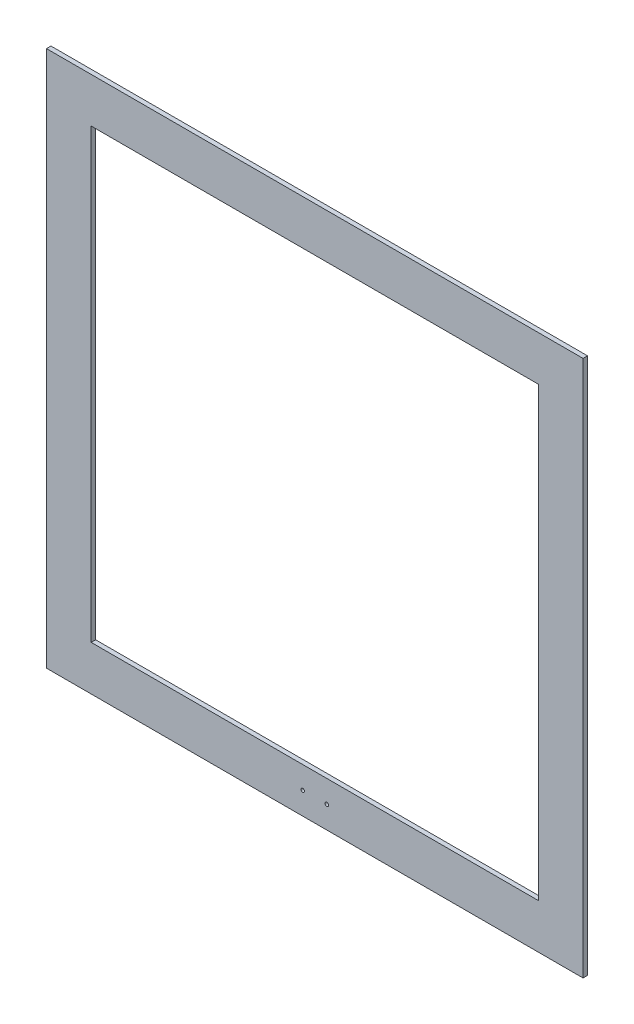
ISO-10303-21;
HEADER;
FILE_DESCRIPTION(('STEP AP214'),'2;1');
FILE_NAME('part.step','',(''),(''),'','','');
FILE_SCHEMA(('AUTOMOTIVE_DESIGN { 1 0 10303 214 1 1 1 1 }'));
ENDSEC;
DATA;
#1=APPLICATION_CONTEXT('core data for automotive mechanical design processes');
#2=APPLICATION_PROTOCOL_DEFINITION('international standard','automotive_design',2000,#1);
#3=PRODUCT_CONTEXT('',#1,'mechanical');
#4=PRODUCT('Part','Part','',(#3));
#5=PRODUCT_RELATED_PRODUCT_CATEGORY('part','',(#4));
#6=PRODUCT_DEFINITION_FORMATION('','',#4);
#7=PRODUCT_DEFINITION_CONTEXT('part definition',#1,'design');
#8=PRODUCT_DEFINITION('design','',#6,#7);
#9=PRODUCT_DEFINITION_SHAPE('','',#8);
#10=(LENGTH_UNIT() NAMED_UNIT(*) SI_UNIT(.MILLI.,.METRE.));
#11=(NAMED_UNIT(*) PLANE_ANGLE_UNIT() SI_UNIT($,.RADIAN.));
#12=(NAMED_UNIT(*) SI_UNIT($,.STERADIAN.) SOLID_ANGLE_UNIT());
#13=UNCERTAINTY_MEASURE_WITH_UNIT(LENGTH_MEASURE(1.E-05),#10,'distance_accuracy_value','');
#14=(GEOMETRIC_REPRESENTATION_CONTEXT(3) GLOBAL_UNCERTAINTY_ASSIGNED_CONTEXT((#13)) GLOBAL_UNIT_ASSIGNED_CONTEXT((#10,
#11,#12)) REPRESENTATION_CONTEXT('',''));
#15=CARTESIAN_POINT('',(0.,0.,0.));
#16=DIRECTION('',(0.,0.,1.));
#17=DIRECTION('',(1.,0.,0.));
#18=AXIS2_PLACEMENT_3D('',#15,#16,#17);
#19=CARTESIAN_POINT('',(0.,0.,5.));
#20=DIRECTION('',(0.,0.,1.));
#21=DIRECTION('',(1.,0.,0.));
#22=AXIS2_PLACEMENT_3D('',#19,#20,#21);
#23=PLANE('',#22);
#24=CARTESIAN_POINT('',(13.5,-275.,5.));
#25=DIRECTION('',(0.,0.,1.));
#26=DIRECTION('',(-1.,0.,0.));
#27=AXIS2_PLACEMENT_3D('',#24,#25,#26);
#28=CIRCLE('',#27,2.);
#29=CARTESIAN_POINT('',(11.5,-275.,5.));
#30=VERTEX_POINT('',#29);
#31=EDGE_CURVE('E227',#30,#30,#28,.T.);
#32=ORIENTED_EDGE('',*,*,#31,.F.);
#33=EDGE_LOOP('',(#32));
#34=FACE_BOUND('',#33,.T.);
#35=CARTESIAN_POINT('',(-13.5,-275.,5.));
#36=DIRECTION('',(0.,0.,1.));
#37=DIRECTION('',(1.,0.,0.));
#38=AXIS2_PLACEMENT_3D('',#35,#36,#37);
#39=CIRCLE('',#38,2.);
#40=CARTESIAN_POINT('',(-11.5,-275.,5.));
#41=VERTEX_POINT('',#40);
#42=EDGE_CURVE('E231',#41,#41,#39,.T.);
#43=ORIENTED_EDGE('',*,*,#42,.F.);
#44=EDGE_LOOP('',(#43));
#45=FACE_BOUND('',#44,.T.);
#46=DIRECTION('',(0.,1.,0.));
#47=VECTOR('',#46,1.);
#48=CARTESIAN_POINT('',(300.,300.,5.));
#49=LINE('',#48,#47);
#50=CARTESIAN_POINT('',(300.,-300.,5.));
#51=VERTEX_POINT('',#50);
#52=CARTESIAN_POINT('',(300.,300.,5.));
#53=VERTEX_POINT('',#52);
#54=EDGE_CURVE('E136',#51,#53,#49,.T.);
#55=ORIENTED_EDGE('',*,*,#54,.T.);
#56=DIRECTION('',(-1.,0.,0.));
#57=VECTOR('',#56,1.);
#58=CARTESIAN_POINT('',(-299.999999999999,300.,5.));
#59=LINE('',#58,#57);
#60=CARTESIAN_POINT('',(-299.999999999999,300.,5.));
#61=VERTEX_POINT('',#60);
#62=EDGE_CURVE('E139',#53,#61,#59,.T.);
#63=ORIENTED_EDGE('',*,*,#62,.T.);
#64=DIRECTION('',(0.,-1.,0.));
#65=VECTOR('',#64,1.);
#66=CARTESIAN_POINT('',(-299.999999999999,300.,5.));
#67=LINE('',#66,#65);
#68=CARTESIAN_POINT('',(-299.999999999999,-300.,5.));
#69=VERTEX_POINT('',#68);
#70=EDGE_CURVE('E142',#61,#69,#67,.T.);
#71=ORIENTED_EDGE('',*,*,#70,.T.);
#72=DIRECTION('',(1.,0.,0.));
#73=VECTOR('',#72,1.);
#74=CARTESIAN_POINT('',(-299.999999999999,-300.,5.));
#75=LINE('',#74,#73);
#76=EDGE_CURVE('E144',#69,#51,#75,.T.);
#77=ORIENTED_EDGE('',*,*,#76,.T.);
#78=EDGE_LOOP('',(#55,#63,#71,#77));
#79=FACE_BOUND('',#78,.T.);
#80=DIRECTION('',(-1.,0.,0.));
#81=VECTOR('',#80,1.);
#82=CARTESIAN_POINT('',(-250.,250.,5.));
#83=LINE('',#82,#81);
#84=CARTESIAN_POINT('',(250.,250.,5.));
#85=VERTEX_POINT('',#84);
#86=CARTESIAN_POINT('',(-250.,250.,5.));
#87=VERTEX_POINT('',#86);
#88=EDGE_CURVE('E106',#85,#87,#83,.T.);
#89=ORIENTED_EDGE('',*,*,#88,.F.);
#90=DIRECTION('',(0.,1.,0.));
#91=VECTOR('',#90,1.);
#92=CARTESIAN_POINT('',(250.,250.,5.));
#93=LINE('',#92,#91);
#94=CARTESIAN_POINT('',(250.,-250.,5.));
#95=VERTEX_POINT('',#94);
#96=EDGE_CURVE('E98',#95,#85,#93,.T.);
#97=ORIENTED_EDGE('',*,*,#96,.F.);
#98=DIRECTION('',(1.,0.,0.));
#99=VECTOR('',#98,1.);
#100=CARTESIAN_POINT('',(-250.,-250.,5.));
#101=LINE('',#100,#99);
#102=CARTESIAN_POINT('',(-250.,-250.,5.));
#103=VERTEX_POINT('',#102);
#104=EDGE_CURVE('E120',#103,#95,#101,.T.);
#105=ORIENTED_EDGE('',*,*,#104,.F.);
#106=DIRECTION('',(0.,-1.,0.));
#107=VECTOR('',#106,1.);
#108=CARTESIAN_POINT('',(-250.,250.,5.));
#109=LINE('',#108,#107);
#110=EDGE_CURVE('E118',#87,#103,#109,.T.);
#111=ORIENTED_EDGE('',*,*,#110,.F.);
#112=EDGE_LOOP('',(#89,#97,#105,#111));
#113=FACE_BOUND('',#112,.T.);
#114=ADVANCED_FACE('F33',(#34,#45,#79,#113),#23,.T.);
#115=CARTESIAN_POINT('',(0.,0.,0.));
#116=DIRECTION('',(0.,0.,1.));
#117=DIRECTION('',(1.,0.,0.));
#118=AXIS2_PLACEMENT_3D('',#115,#116,#117);
#119=PLANE('',#118);
#120=CARTESIAN_POINT('',(13.5,-275.,0.));
#121=DIRECTION('',(0.,0.,1.));
#122=DIRECTION('',(1.,0.,0.));
#123=AXIS2_PLACEMENT_3D('',#120,#121,#122);
#124=CIRCLE('',#123,2.);
#125=CARTESIAN_POINT('',(15.5,-275.,0.));
#126=VERTEX_POINT('',#125);
#127=EDGE_CURVE('E230',#126,#126,#124,.F.);
#128=ORIENTED_EDGE('',*,*,#127,.F.);
#129=EDGE_LOOP('',(#128));
#130=FACE_BOUND('',#129,.T.);
#131=CARTESIAN_POINT('',(-13.5,-275.,0.));
#132=DIRECTION('',(0.,0.,1.));
#133=DIRECTION('',(1.,0.,0.));
#134=AXIS2_PLACEMENT_3D('',#131,#132,#133);
#135=CIRCLE('',#134,2.);
#136=CARTESIAN_POINT('',(-11.5,-275.,0.));
#137=VERTEX_POINT('',#136);
#138=EDGE_CURVE('E126',#137,#137,#135,.F.);
#139=ORIENTED_EDGE('',*,*,#138,.F.);
#140=EDGE_LOOP('',(#139));
#141=FACE_BOUND('',#140,.T.);
#142=DIRECTION('',(0.,1.,0.));
#143=VECTOR('',#142,1.);
#144=CARTESIAN_POINT('',(300.,300.,0.));
#145=LINE('',#144,#143);
#146=CARTESIAN_POINT('',(300.,-300.,0.));
#147=VERTEX_POINT('',#146);
#148=CARTESIAN_POINT('',(300.,300.,0.));
#149=VERTEX_POINT('',#148);
#150=EDGE_CURVE('E114',#147,#149,#145,.T.);
#151=ORIENTED_EDGE('',*,*,#150,.F.);
#152=DIRECTION('',(1.,0.,0.));
#153=VECTOR('',#152,1.);
#154=CARTESIAN_POINT('',(-299.999999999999,-300.,0.));
#155=LINE('',#154,#153);
#156=CARTESIAN_POINT('',(-299.999999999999,-300.,0.));
#157=VERTEX_POINT('',#156);
#158=EDGE_CURVE('E140',#157,#147,#155,.T.);
#159=ORIENTED_EDGE('',*,*,#158,.F.);
#160=DIRECTION('',(0.,-1.,0.));
#161=VECTOR('',#160,1.);
#162=CARTESIAN_POINT('',(-299.999999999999,300.,0.));
#163=LINE('',#162,#161);
#164=CARTESIAN_POINT('',(-299.999999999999,300.,0.));
#165=VERTEX_POINT('',#164);
#166=EDGE_CURVE('E151',#165,#157,#163,.T.);
#167=ORIENTED_EDGE('',*,*,#166,.F.);
#168=DIRECTION('',(-1.,0.,0.));
#169=VECTOR('',#168,1.);
#170=CARTESIAN_POINT('',(-299.999999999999,300.,0.));
#171=LINE('',#170,#169);
#172=EDGE_CURVE('E149',#149,#165,#171,.T.);
#173=ORIENTED_EDGE('',*,*,#172,.F.);
#174=EDGE_LOOP('',(#151,#159,#167,#173));
#175=FACE_BOUND('',#174,.T.);
#176=DIRECTION('',(0.,1.,0.));
#177=VECTOR('',#176,1.);
#178=CARTESIAN_POINT('',(250.,250.,0.));
#179=LINE('',#178,#177);
#180=CARTESIAN_POINT('',(250.,-250.,0.));
#181=VERTEX_POINT('',#180);
#182=CARTESIAN_POINT('',(250.,250.,0.));
#183=VERTEX_POINT('',#182);
#184=EDGE_CURVE('E56',#181,#183,#179,.T.);
#185=ORIENTED_EDGE('',*,*,#184,.T.);
#186=DIRECTION('',(-1.,0.,0.));
#187=VECTOR('',#186,1.);
#188=CARTESIAN_POINT('',(-250.,250.,0.));
#189=LINE('',#188,#187);
#190=CARTESIAN_POINT('',(-250.,250.,0.));
#191=VERTEX_POINT('',#190);
#192=EDGE_CURVE('E113',#183,#191,#189,.T.);
#193=ORIENTED_EDGE('',*,*,#192,.T.);
#194=DIRECTION('',(0.,-1.,0.));
#195=VECTOR('',#194,1.);
#196=CARTESIAN_POINT('',(-250.,250.,0.));
#197=LINE('',#196,#195);
#198=CARTESIAN_POINT('',(-250.,-250.,0.));
#199=VERTEX_POINT('',#198);
#200=EDGE_CURVE('E128',#191,#199,#197,.T.);
#201=ORIENTED_EDGE('',*,*,#200,.T.);
#202=DIRECTION('',(1.,0.,0.));
#203=VECTOR('',#202,1.);
#204=CARTESIAN_POINT('',(-250.,-250.,0.));
#205=LINE('',#204,#203);
#206=EDGE_CURVE('E107',#199,#181,#205,.T.);
#207=ORIENTED_EDGE('',*,*,#206,.T.);
#208=EDGE_LOOP('',(#185,#193,#201,#207));
#209=FACE_BOUND('',#208,.T.);
#210=ADVANCED_FACE('F169',(#130,#141,#175,#209),#119,.F.);
#211=CARTESIAN_POINT('',(300.,300.,5.));
#212=DIRECTION('',(-1.,0.,0.));
#213=DIRECTION('',(0.,0.,1.));
#214=AXIS2_PLACEMENT_3D('',#211,#212,#213);
#215=PLANE('',#214);
#216=ORIENTED_EDGE('',*,*,#150,.T.);
#217=DIRECTION('',(0.,0.,-1.));
#218=VECTOR('',#217,1.);
#219=CARTESIAN_POINT('',(300.,300.,5.));
#220=LINE('',#219,#218);
#221=EDGE_CURVE('E11',#53,#149,#220,.T.);
#222=ORIENTED_EDGE('',*,*,#221,.F.);
#223=ORIENTED_EDGE('',*,*,#54,.F.);
#224=DIRECTION('',(0.,0.,-1.));
#225=VECTOR('',#224,1.);
#226=CARTESIAN_POINT('',(300.,-300.,5.));
#227=LINE('',#226,#225);
#228=EDGE_CURVE('E146',#51,#147,#227,.T.);
#229=ORIENTED_EDGE('',*,*,#228,.T.);
#230=EDGE_LOOP('',(#216,#222,#223,#229));
#231=FACE_BOUND('',#230,.T.);
#232=ADVANCED_FACE('F35',(#231),#215,.F.);
#233=CARTESIAN_POINT('',(-299.999999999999,300.,5.));
#234=DIRECTION('',(0.,-1.,0.));
#235=DIRECTION('',(1.,0.,0.));
#236=AXIS2_PLACEMENT_3D('',#233,#234,#235);
#237=PLANE('',#236);
#238=ORIENTED_EDGE('',*,*,#172,.T.);
#239=DIRECTION('',(0.,0.,-1.));
#240=VECTOR('',#239,1.);
#241=CARTESIAN_POINT('',(-299.999999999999,300.,5.));
#242=LINE('',#241,#240);
#243=EDGE_CURVE('E41',#61,#165,#242,.T.);
#244=ORIENTED_EDGE('',*,*,#243,.F.);
#245=ORIENTED_EDGE('',*,*,#62,.F.);
#246=ORIENTED_EDGE('',*,*,#221,.T.);
#247=EDGE_LOOP('',(#238,#244,#245,#246));
#248=FACE_BOUND('',#247,.T.);
#249=ADVANCED_FACE('F179',(#248),#237,.F.);
#250=CARTESIAN_POINT('',(-299.999999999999,300.,5.));
#251=DIRECTION('',(1.,0.,0.));
#252=DIRECTION('',(0.,0.,-1.));
#253=AXIS2_PLACEMENT_3D('',#250,#251,#252);
#254=PLANE('',#253);
#255=ORIENTED_EDGE('',*,*,#166,.T.);
#256=DIRECTION('',(0.,0.,-1.));
#257=VECTOR('',#256,1.);
#258=CARTESIAN_POINT('',(-299.999999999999,-300.,5.));
#259=LINE('',#258,#257);
#260=EDGE_CURVE('E156',#69,#157,#259,.T.);
#261=ORIENTED_EDGE('',*,*,#260,.F.);
#262=ORIENTED_EDGE('',*,*,#70,.F.);
#263=ORIENTED_EDGE('',*,*,#243,.T.);
#264=EDGE_LOOP('',(#255,#261,#262,#263));
#265=FACE_BOUND('',#264,.T.);
#266=ADVANCED_FACE('F163',(#265),#254,.F.);
#267=CARTESIAN_POINT('',(-299.999999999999,-300.,5.));
#268=DIRECTION('',(0.,1.,0.));
#269=DIRECTION('',(0.,0.,1.));
#270=AXIS2_PLACEMENT_3D('',#267,#268,#269);
#271=PLANE('',#270);
#272=ORIENTED_EDGE('',*,*,#158,.T.);
#273=ORIENTED_EDGE('',*,*,#228,.F.);
#274=ORIENTED_EDGE('',*,*,#76,.F.);
#275=ORIENTED_EDGE('',*,*,#260,.T.);
#276=EDGE_LOOP('',(#272,#273,#274,#275));
#277=FACE_BOUND('',#276,.T.);
#278=ADVANCED_FACE('F173',(#277),#271,.F.);
#279=CARTESIAN_POINT('',(250.,250.,5.));
#280=DIRECTION('',(-1.,0.,0.));
#281=DIRECTION('',(0.,-1.,0.));
#282=AXIS2_PLACEMENT_3D('',#279,#280,#281);
#283=PLANE('',#282);
#284=ORIENTED_EDGE('',*,*,#184,.F.);
#285=DIRECTION('',(0.,0.,-1.));
#286=VECTOR('',#285,1.);
#287=CARTESIAN_POINT('',(250.,-250.,5.));
#288=LINE('',#287,#286);
#289=EDGE_CURVE('E102',#95,#181,#288,.T.);
#290=ORIENTED_EDGE('',*,*,#289,.F.);
#291=ORIENTED_EDGE('',*,*,#96,.T.);
#292=DIRECTION('',(0.,0.,-1.));
#293=VECTOR('',#292,1.);
#294=CARTESIAN_POINT('',(250.,250.,5.));
#295=LINE('',#294,#293);
#296=EDGE_CURVE('E101',#85,#183,#295,.T.);
#297=ORIENTED_EDGE('',*,*,#296,.T.);
#298=EDGE_LOOP('',(#284,#290,#291,#297));
#299=FACE_BOUND('',#298,.T.);
#300=ADVANCED_FACE('F100',(#299),#283,.T.);
#301=CARTESIAN_POINT('',(-250.,250.,5.));
#302=DIRECTION('',(0.,-1.,0.));
#303=DIRECTION('',(1.,0.,0.));
#304=AXIS2_PLACEMENT_3D('',#301,#302,#303);
#305=PLANE('',#304);
#306=ORIENTED_EDGE('',*,*,#192,.F.);
#307=ORIENTED_EDGE('',*,*,#296,.F.);
#308=ORIENTED_EDGE('',*,*,#88,.T.);
#309=DIRECTION('',(0.,0.,-1.));
#310=VECTOR('',#309,1.);
#311=CARTESIAN_POINT('',(-250.,250.,5.));
#312=LINE('',#311,#310);
#313=EDGE_CURVE('E115',#87,#191,#312,.T.);
#314=ORIENTED_EDGE('',*,*,#313,.T.);
#315=EDGE_LOOP('',(#306,#307,#308,#314));
#316=FACE_BOUND('',#315,.T.);
#317=ADVANCED_FACE('F110',(#316),#305,.T.);
#318=CARTESIAN_POINT('',(-250.,250.,5.));
#319=DIRECTION('',(1.,0.,0.));
#320=DIRECTION('',(0.,0.,-1.));
#321=AXIS2_PLACEMENT_3D('',#318,#319,#320);
#322=PLANE('',#321);
#323=ORIENTED_EDGE('',*,*,#200,.F.);
#324=ORIENTED_EDGE('',*,*,#313,.F.);
#325=ORIENTED_EDGE('',*,*,#110,.T.);
#326=DIRECTION('',(0.,0.,-1.));
#327=VECTOR('',#326,1.);
#328=CARTESIAN_POINT('',(-250.,-250.,5.));
#329=LINE('',#328,#327);
#330=EDGE_CURVE('E48',#103,#199,#329,.T.);
#331=ORIENTED_EDGE('',*,*,#330,.T.);
#332=EDGE_LOOP('',(#323,#324,#325,#331));
#333=FACE_BOUND('',#332,.T.);
#334=ADVANCED_FACE('F206',(#333),#322,.T.);
#335=CARTESIAN_POINT('',(-250.,-250.,5.));
#336=DIRECTION('',(0.,1.,0.));
#337=DIRECTION('',(0.,0.,1.));
#338=AXIS2_PLACEMENT_3D('',#335,#336,#337);
#339=PLANE('',#338);
#340=ORIENTED_EDGE('',*,*,#206,.F.);
#341=ORIENTED_EDGE('',*,*,#330,.F.);
#342=ORIENTED_EDGE('',*,*,#104,.T.);
#343=ORIENTED_EDGE('',*,*,#289,.T.);
#344=EDGE_LOOP('',(#340,#341,#342,#343));
#345=FACE_BOUND('',#344,.T.);
#346=ADVANCED_FACE('F210',(#345),#339,.T.);
#347=CARTESIAN_POINT('',(-13.5,-275.,-0.00100000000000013));
#348=DIRECTION('',(0.,0.,1.));
#349=DIRECTION('',(1.,0.,0.));
#350=AXIS2_PLACEMENT_3D('',#347,#348,#349);
#351=CYLINDRICAL_SURFACE('',#350,2.);
#352=ORIENTED_EDGE('',*,*,#42,.T.);
#353=EDGE_LOOP('',(#352));
#354=FACE_BOUND('',#353,.T.);
#355=ORIENTED_EDGE('',*,*,#138,.T.);
#356=EDGE_LOOP('',(#355));
#357=FACE_BOUND('',#356,.T.);
#358=ADVANCED_FACE('F216',(#354,#357),#351,.F.);
#359=CARTESIAN_POINT('',(13.5,-275.,-0.00100000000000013));
#360=DIRECTION('',(0.,0.,1.));
#361=DIRECTION('',(1.,0.,0.));
#362=AXIS2_PLACEMENT_3D('',#359,#360,#361);
#363=CYLINDRICAL_SURFACE('',#362,2.);
#364=ORIENTED_EDGE('',*,*,#31,.T.);
#365=EDGE_LOOP('',(#364));
#366=FACE_BOUND('',#365,.T.);
#367=ORIENTED_EDGE('',*,*,#127,.T.);
#368=EDGE_LOOP('',(#367));
#369=FACE_BOUND('',#368,.T.);
#370=ADVANCED_FACE('F219',(#366,#369),#363,.F.);
#371=CLOSED_SHELL('',(#114,#210,#232,#249,#266,#278,#300,#317,#334,#346,#358,#370));
#372=MANIFOLD_SOLID_BREP('B2',#371);
#373=ADVANCED_BREP_SHAPE_REPRESENTATION('',(#18,#372),#14);
#374=SHAPE_DEFINITION_REPRESENTATION(#9,#373);
ENDSEC;
END-ISO-10303-21;
